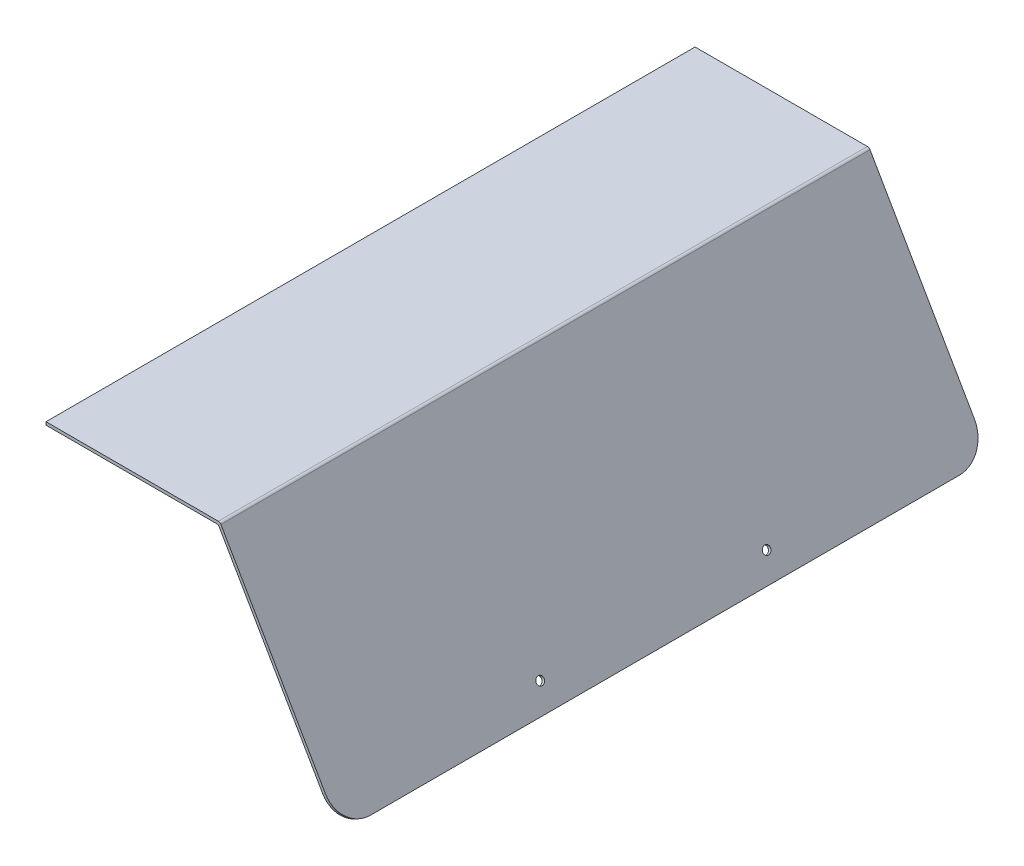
ISO-10303-21;
HEADER;
FILE_DESCRIPTION(('STEP AP214'),'2;1');
FILE_NAME('part.step','',(''),(''),'','','');
FILE_SCHEMA(('AUTOMOTIVE_DESIGN { 1 0 10303 214 1 1 1 1 }'));
ENDSEC;
DATA;
#1=APPLICATION_CONTEXT('core data for automotive mechanical design processes');
#2=APPLICATION_PROTOCOL_DEFINITION('international standard','automotive_design',2000,#1);
#3=PRODUCT_CONTEXT('',#1,'mechanical');
#4=PRODUCT('Part','Part','',(#3));
#5=PRODUCT_RELATED_PRODUCT_CATEGORY('part','',(#4));
#6=PRODUCT_DEFINITION_FORMATION('','',#4);
#7=PRODUCT_DEFINITION_CONTEXT('part definition',#1,'design');
#8=PRODUCT_DEFINITION('design','',#6,#7);
#9=PRODUCT_DEFINITION_SHAPE('','',#8);
#10=(LENGTH_UNIT() NAMED_UNIT(*) SI_UNIT(.MILLI.,.METRE.));
#11=(NAMED_UNIT(*) PLANE_ANGLE_UNIT() SI_UNIT($,.RADIAN.));
#12=(NAMED_UNIT(*) SI_UNIT($,.STERADIAN.) SOLID_ANGLE_UNIT());
#13=UNCERTAINTY_MEASURE_WITH_UNIT(LENGTH_MEASURE(1.E-05),#10,'distance_accuracy_value','');
#14=(GEOMETRIC_REPRESENTATION_CONTEXT(3) GLOBAL_UNCERTAINTY_ASSIGNED_CONTEXT((#13)) GLOBAL_UNIT_ASSIGNED_CONTEXT((#10,
#11,#12)) REPRESENTATION_CONTEXT('',''));
#15=CARTESIAN_POINT('',(0.,0.,0.));
#16=DIRECTION('',(0.,0.,1.));
#17=DIRECTION('',(1.,0.,0.));
#18=AXIS2_PLACEMENT_3D('',#15,#16,#17);
#19=CARTESIAN_POINT('',(39.,135.000000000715,-669.643858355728));
#20=DIRECTION('',(-1.,0.,0.));
#21=DIRECTION('',(0.,0.,1.));
#22=AXIS2_PLACEMENT_3D('',#19,#20,#21);
#23=PLANE('',#22);
#24=DIRECTION('',(0.,1.,0.));
#25=VECTOR('',#24,1.);
#26=CARTESIAN_POINT('',(39.,135.000000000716,-430.));
#27=LINE('',#26,#25);
#28=CARTESIAN_POINT('',(39.,135.000000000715,-430.));
#29=VERTEX_POINT('',#28);
#30=CARTESIAN_POINT('',(39.,137.000000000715,-430.));
#31=VERTEX_POINT('',#30);
#32=EDGE_CURVE('E125',#29,#31,#27,.T.);
#33=ORIENTED_EDGE('',*,*,#32,.F.);
#34=DIRECTION('',(0.,0.,1.));
#35=VECTOR('',#34,1.);
#36=CARTESIAN_POINT('',(39.,135.000000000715,-669.643858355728));
#37=LINE('',#36,#35);
#38=CARTESIAN_POINT('',(39.,135.000000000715,0.));
#39=VERTEX_POINT('',#38);
#40=EDGE_CURVE('E119',#29,#39,#37,.T.);
#41=ORIENTED_EDGE('',*,*,#40,.T.);
#42=DIRECTION('',(0.,-1.,0.));
#43=VECTOR('',#42,1.);
#44=CARTESIAN_POINT('',(39.,135.000000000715,0.));
#45=LINE('',#44,#43);
#46=CARTESIAN_POINT('',(39.,137.000000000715,0.));
#47=VERTEX_POINT('',#46);
#48=EDGE_CURVE('E123',#47,#39,#45,.T.);
#49=ORIENTED_EDGE('',*,*,#48,.F.);
#50=DIRECTION('',(0.,0.,1.));
#51=VECTOR('',#50,1.);
#52=CARTESIAN_POINT('',(39.,137.000000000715,-669.643858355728));
#53=LINE('',#52,#51);
#54=EDGE_CURVE('E160',#31,#47,#53,.T.);
#55=ORIENTED_EDGE('',*,*,#54,.F.);
#56=EDGE_LOOP('',(#33,#41,#49,#55));
#57=FACE_BOUND('',#56,.T.);
#58=ADVANCED_FACE('F39',(#57),#23,.T.);
#59=CARTESIAN_POINT('',(39.,137.000000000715,-669.643858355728));
#60=DIRECTION('',(0.,1.,0.));
#61=DIRECTION('',(-1.,0.,0.));
#62=AXIS2_PLACEMENT_3D('',#59,#60,#61);
#63=PLANE('',#62);
#64=DIRECTION('',(1.,0.,0.));
#65=VECTOR('',#64,1.);
#66=CARTESIAN_POINT('',(39.,137.000000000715,-430.));
#67=LINE('',#66,#65);
#68=CARTESIAN_POINT('',(153.154700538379,137.000000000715,-430.));
#69=VERTEX_POINT('',#68);
#70=EDGE_CURVE('E212',#31,#69,#67,.T.);
#71=ORIENTED_EDGE('',*,*,#70,.F.);
#72=ORIENTED_EDGE('',*,*,#54,.T.);
#73=DIRECTION('',(-1.,0.,0.));
#74=VECTOR('',#73,1.);
#75=CARTESIAN_POINT('',(39.,137.000000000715,0.));
#76=LINE('',#75,#74);
#77=CARTESIAN_POINT('',(153.154700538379,137.000000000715,0.));
#78=VERTEX_POINT('',#77);
#79=EDGE_CURVE('E129',#78,#47,#76,.T.);
#80=ORIENTED_EDGE('',*,*,#79,.F.);
#81=DIRECTION('',(0.,0.,1.));
#82=VECTOR('',#81,1.);
#83=CARTESIAN_POINT('',(153.154700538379,137.000000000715,-669.643858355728));
#84=LINE('',#83,#82);
#85=EDGE_CURVE('E163',#69,#78,#84,.T.);
#86=ORIENTED_EDGE('',*,*,#85,.F.);
#87=EDGE_LOOP('',(#71,#72,#80,#86));
#88=FACE_BOUND('',#87,.T.);
#89=ADVANCED_FACE('F219',(#88),#63,.T.);
#90=CARTESIAN_POINT('',(153.154700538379,135.000000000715,-669.643858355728));
#91=DIRECTION('',(0.,0.,1.));
#92=DIRECTION('',(1.,0.,0.));
#93=AXIS2_PLACEMENT_3D('',#90,#91,#92);
#94=CYLINDRICAL_SURFACE('',#93,2.);
#95=CARTESIAN_POINT('',(153.154700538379,135.000000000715,-430.));
#96=DIRECTION('',(0.,0.,1.));
#97=DIRECTION('',(0.,-1.,0.));
#98=AXIS2_PLACEMENT_3D('',#95,#96,#97);
#99=CIRCLE('',#98,2.);
#100=CARTESIAN_POINT('',(154.886751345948,136.000000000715,-430.));
#101=VERTEX_POINT('',#100);
#102=EDGE_CURVE('E209',#69,#101,#99,.F.);
#103=ORIENTED_EDGE('',*,*,#102,.F.);
#104=ORIENTED_EDGE('',*,*,#85,.T.);
#105=CARTESIAN_POINT('',(153.154700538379,135.000000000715,0.));
#106=DIRECTION('',(0.,0.,1.));
#107=DIRECTION('',(-1.,0.,0.));
#108=AXIS2_PLACEMENT_3D('',#105,#106,#107);
#109=CIRCLE('',#108,2.);
#110=CARTESIAN_POINT('',(154.886751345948,136.000000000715,0.));
#111=VERTEX_POINT('',#110);
#112=EDGE_CURVE('E157',#111,#78,#109,.T.);
#113=ORIENTED_EDGE('',*,*,#112,.F.);
#114=DIRECTION('',(0.,0.,1.));
#115=VECTOR('',#114,1.);
#116=CARTESIAN_POINT('',(154.886751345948,136.000000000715,-669.643858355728));
#117=LINE('',#116,#115);
#118=EDGE_CURVE('E165',#101,#111,#117,.T.);
#119=ORIENTED_EDGE('',*,*,#118,.F.);
#120=EDGE_LOOP('',(#103,#104,#113,#119));
#121=FACE_BOUND('',#120,.T.);
#122=ADVANCED_FACE('F222',(#121),#94,.T.);
#123=CARTESIAN_POINT('',(154.886751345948,136.000000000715,-669.643858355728));
#124=DIRECTION('',(0.86602540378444,0.499999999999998,0.));
#125=DIRECTION('',(-0.499999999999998,0.86602540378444,0.));
#126=AXIS2_PLACEMENT_3D('',#123,#124,#125);
#127=PLANE('',#126);
#128=CARTESIAN_POINT('',(226.411412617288,12.1156526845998,-139.999999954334));
#129=DIRECTION('',(0.86602540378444,0.499999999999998,0.));
#130=DIRECTION('',(-0.499999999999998,0.86602540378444,0.));
#131=AXIS2_PLACEMENT_3D('',#128,#129,#130);
#132=CIRCLE('',#131,2.58750000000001);
#133=CARTESIAN_POINT('',(225.117662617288,14.356493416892,-139.999999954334));
#134=VERTEX_POINT('',#133);
#135=EDGE_CURVE('E147',#134,#134,#132,.T.);
#136=ORIENTED_EDGE('',*,*,#135,.F.);
#137=EDGE_LOOP('',(#136));
#138=FACE_BOUND('',#137,.T.);
#139=CARTESIAN_POINT('',(226.411412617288,12.1156526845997,-290.000000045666));
#140=DIRECTION('',(0.86602540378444,0.499999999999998,0.));
#141=DIRECTION('',(-0.499999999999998,0.86602540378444,0.));
#142=AXIS2_PLACEMENT_3D('',#139,#140,#141);
#143=CIRCLE('',#142,2.58749999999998);
#144=CARTESIAN_POINT('',(225.117662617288,14.3564934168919,-290.000000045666));
#145=VERTEX_POINT('',#144);
#146=EDGE_CURVE('E271',#145,#145,#143,.T.);
#147=ORIENTED_EDGE('',*,*,#146,.F.);
#148=EDGE_LOOP('',(#147));
#149=FACE_BOUND('',#148,.T.);
#150=DIRECTION('',(-0.499999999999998,0.866025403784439,0.));
#151=VECTOR('',#150,1.);
#152=CARTESIAN_POINT('',(154.886751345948,136.000000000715,0.));
#153=LINE('',#152,#151);
#154=CARTESIAN_POINT('',(224.086412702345,16.142670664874,0.));
#155=VERTEX_POINT('',#154);
#156=EDGE_CURVE('E155',#155,#111,#153,.T.);
#157=ORIENTED_EDGE('',*,*,#156,.F.);
#158=CARTESIAN_POINT('',(224.086412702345,16.142670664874,-20.));
#159=DIRECTION('',(0.86602540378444,0.499999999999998,0.));
#160=DIRECTION('',(-0.499999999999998,0.86602540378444,0.));
#161=AXIS2_PLACEMENT_3D('',#158,#159,#160);
#162=CIRCLE('',#161,20.);
#163=CARTESIAN_POINT('',(234.086412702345,-1.17783741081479,-20.));
#164=VERTEX_POINT('',#163);
#165=EDGE_CURVE('E182',#155,#164,#162,.T.);
#166=ORIENTED_EDGE('',*,*,#165,.T.);
#167=DIRECTION('',(0.,0.,1.));
#168=VECTOR('',#167,1.);
#169=CARTESIAN_POINT('',(234.086412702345,-1.17783741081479,-669.643858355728));
#170=LINE('',#169,#168);
#171=CARTESIAN_POINT('',(234.086412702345,-1.17783741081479,-410.));
#172=VERTEX_POINT('',#171);
#173=EDGE_CURVE('E168',#172,#164,#170,.T.);
#174=ORIENTED_EDGE('',*,*,#173,.F.);
#175=CARTESIAN_POINT('',(224.086412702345,16.142670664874,-410.));
#176=DIRECTION('',(0.86602540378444,0.499999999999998,0.));
#177=DIRECTION('',(-0.499999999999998,0.86602540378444,0.));
#178=AXIS2_PLACEMENT_3D('',#175,#176,#177);
#179=CIRCLE('',#178,20.);
#180=CARTESIAN_POINT('',(224.086412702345,16.142670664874,-430.));
#181=VERTEX_POINT('',#180);
#182=EDGE_CURVE('E180',#172,#181,#179,.T.);
#183=ORIENTED_EDGE('',*,*,#182,.T.);
#184=DIRECTION('',(0.499999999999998,-0.86602540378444,0.));
#185=VECTOR('',#184,1.);
#186=CARTESIAN_POINT('',(154.886751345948,136.000000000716,-430.));
#187=LINE('',#186,#185);
#188=EDGE_CURVE('E203',#101,#181,#187,.T.);
#189=ORIENTED_EDGE('',*,*,#188,.F.);
#190=ORIENTED_EDGE('',*,*,#118,.T.);
#191=EDGE_LOOP('',(#157,#166,#174,#183,#189,#190));
#192=FACE_BOUND('',#191,.T.);
#193=ADVANCED_FACE('F198',(#138,#149,#192),#127,.T.);
#194=CARTESIAN_POINT('',(232.354361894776,-2.1778374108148,-669.643858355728));
#195=DIRECTION('',(0.499999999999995,-0.866025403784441,0.));
#196=DIRECTION('',(0.866025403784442,0.499999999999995,0.));
#197=AXIS2_PLACEMENT_3D('',#194,#195,#196);
#198=PLANE('',#197);
#199=ORIENTED_EDGE('',*,*,#173,.T.);
#200=DIRECTION('',(0.866025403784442,0.499999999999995,0.));
#201=VECTOR('',#200,1.);
#202=CARTESIAN_POINT('',(232.354361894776,-2.1778374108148,-20.));
#203=LINE('',#202,#201);
#204=CARTESIAN_POINT('',(232.354361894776,-2.1778374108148,-20.));
#205=VERTEX_POINT('',#204);
#206=EDGE_CURVE('E61',#164,#205,#203,.F.);
#207=ORIENTED_EDGE('',*,*,#206,.T.);
#208=DIRECTION('',(0.,0.,1.));
#209=VECTOR('',#208,1.);
#210=CARTESIAN_POINT('',(232.354361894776,-2.1778374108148,-669.643858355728));
#211=LINE('',#210,#209);
#212=CARTESIAN_POINT('',(232.354361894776,-2.1778374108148,-410.));
#213=VERTEX_POINT('',#212);
#214=EDGE_CURVE('E170',#213,#205,#211,.T.);
#215=ORIENTED_EDGE('',*,*,#214,.F.);
#216=DIRECTION('',(-0.866025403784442,-0.499999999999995,0.));
#217=VECTOR('',#216,1.);
#218=CARTESIAN_POINT('',(234.086412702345,-1.17783741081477,-410.));
#219=LINE('',#218,#217);
#220=EDGE_CURVE('E184',#213,#172,#219,.F.);
#221=ORIENTED_EDGE('',*,*,#220,.T.);
#222=EDGE_LOOP('',(#199,#207,#215,#221));
#223=FACE_BOUND('',#222,.T.);
#224=ADVANCED_FACE('F200',(#223),#198,.T.);
#225=CARTESIAN_POINT('',(153.732050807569,134.000000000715,-669.643858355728));
#226=DIRECTION('',(-0.86602540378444,-0.499999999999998,0.));
#227=DIRECTION('',(0.499999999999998,-0.86602540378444,0.));
#228=AXIS2_PLACEMENT_3D('',#225,#226,#227);
#229=PLANE('',#228);
#230=CARTESIAN_POINT('',(224.679361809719,11.1156526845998,-139.999999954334));
#231=DIRECTION('',(-0.86602540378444,-0.499999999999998,0.));
#232=DIRECTION('',(0.499999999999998,-0.86602540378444,0.));
#233=AXIS2_PLACEMENT_3D('',#230,#231,#232);
#234=CIRCLE('',#233,2.58750000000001);
#235=CARTESIAN_POINT('',(225.973111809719,8.87481195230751,-139.999999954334));
#236=VERTEX_POINT('',#235);
#237=EDGE_CURVE('E144',#236,#236,#234,.F.);
#238=ORIENTED_EDGE('',*,*,#237,.T.);
#239=EDGE_LOOP('',(#238));
#240=FACE_BOUND('',#239,.T.);
#241=CARTESIAN_POINT('',(224.679361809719,11.1156526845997,-290.000000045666));
#242=DIRECTION('',(-0.86602540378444,-0.499999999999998,0.));
#243=DIRECTION('',(0.499999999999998,-0.86602540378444,0.));
#244=AXIS2_PLACEMENT_3D('',#241,#242,#243);
#245=CIRCLE('',#244,2.58749999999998);
#246=CARTESIAN_POINT('',(225.973111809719,8.87481195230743,-290.000000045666));
#247=VERTEX_POINT('',#246);
#248=EDGE_CURVE('E269',#247,#247,#245,.F.);
#249=ORIENTED_EDGE('',*,*,#248,.T.);
#250=EDGE_LOOP('',(#249));
#251=FACE_BOUND('',#250,.T.);
#252=ORIENTED_EDGE('',*,*,#214,.T.);
#253=CARTESIAN_POINT('',(222.354361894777,15.142670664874,-20.));
#254=DIRECTION('',(-0.86602540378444,-0.499999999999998,0.));
#255=DIRECTION('',(0.499999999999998,-0.86602540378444,0.));
#256=AXIS2_PLACEMENT_3D('',#253,#254,#255);
#257=CIRCLE('',#256,20.);
#258=CARTESIAN_POINT('',(222.354361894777,15.142670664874,0.));
#259=VERTEX_POINT('',#258);
#260=EDGE_CURVE('E47',#205,#259,#257,.T.);
#261=ORIENTED_EDGE('',*,*,#260,.T.);
#262=DIRECTION('',(0.499999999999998,-0.86602540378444,0.));
#263=VECTOR('',#262,1.);
#264=CARTESIAN_POINT('',(153.732050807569,134.000000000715,0.));
#265=LINE('',#264,#263);
#266=CARTESIAN_POINT('',(153.732050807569,134.000000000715,0.));
#267=VERTEX_POINT('',#266);
#268=EDGE_CURVE('E153',#267,#259,#265,.T.);
#269=ORIENTED_EDGE('',*,*,#268,.F.);
#270=DIRECTION('',(0.,0.,1.));
#271=VECTOR('',#270,1.);
#272=CARTESIAN_POINT('',(153.732050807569,134.000000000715,-669.643858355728));
#273=LINE('',#272,#271);
#274=CARTESIAN_POINT('',(153.732050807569,134.000000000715,-430.));
#275=VERTEX_POINT('',#274);
#276=EDGE_CURVE('E172',#275,#267,#273,.T.);
#277=ORIENTED_EDGE('',*,*,#276,.F.);
#278=DIRECTION('',(-0.499999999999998,0.86602540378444,0.));
#279=VECTOR('',#278,1.);
#280=CARTESIAN_POINT('',(153.732050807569,134.000000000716,-430.));
#281=LINE('',#280,#279);
#282=CARTESIAN_POINT('',(222.354361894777,15.1426706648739,-430.));
#283=VERTEX_POINT('',#282);
#284=EDGE_CURVE('E210',#283,#275,#281,.T.);
#285=ORIENTED_EDGE('',*,*,#284,.F.);
#286=CARTESIAN_POINT('',(222.354361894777,15.142670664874,-410.));
#287=DIRECTION('',(-0.86602540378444,-0.499999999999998,0.));
#288=DIRECTION('',(0.499999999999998,-0.86602540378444,0.));
#289=AXIS2_PLACEMENT_3D('',#286,#287,#288);
#290=CIRCLE('',#289,20.);
#291=EDGE_CURVE('E54',#283,#213,#290,.T.);
#292=ORIENTED_EDGE('',*,*,#291,.T.);
#293=EDGE_LOOP('',(#252,#261,#269,#277,#285,#292));
#294=FACE_BOUND('',#293,.T.);
#295=ADVANCED_FACE('F190',(#240,#251,#294),#229,.T.);
#296=CARTESIAN_POINT('',(152.,133.000000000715,-669.643858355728));
#297=DIRECTION('',(0.,0.,1.));
#298=DIRECTION('',(1.,0.,0.));
#299=AXIS2_PLACEMENT_3D('',#296,#297,#298);
#300=CYLINDRICAL_SURFACE('',#299,1.99999999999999);
#301=CARTESIAN_POINT('',(152.,133.000000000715,-430.));
#302=DIRECTION('',(0.,0.,1.));
#303=DIRECTION('',(0.,-1.,0.));
#304=AXIS2_PLACEMENT_3D('',#301,#302,#303);
#305=CIRCLE('',#304,1.99999999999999);
#306=CARTESIAN_POINT('',(152.,135.000000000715,-430.));
#307=VERTEX_POINT('',#306);
#308=EDGE_CURVE('E162',#275,#307,#305,.T.);
#309=ORIENTED_EDGE('',*,*,#308,.F.);
#310=ORIENTED_EDGE('',*,*,#276,.T.);
#311=CARTESIAN_POINT('',(152.,133.000000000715,0.));
#312=DIRECTION('',(0.,0.,-1.));
#313=DIRECTION('',(-1.,0.,0.));
#314=AXIS2_PLACEMENT_3D('',#311,#312,#313);
#315=CIRCLE('',#314,1.99999999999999);
#316=CARTESIAN_POINT('',(152.,135.000000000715,0.));
#317=VERTEX_POINT('',#316);
#318=EDGE_CURVE('E138',#317,#267,#315,.T.);
#319=ORIENTED_EDGE('',*,*,#318,.F.);
#320=DIRECTION('',(0.,0.,1.));
#321=VECTOR('',#320,1.);
#322=CARTESIAN_POINT('',(152.,135.000000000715,-669.643858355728));
#323=LINE('',#322,#321);
#324=EDGE_CURVE('E128',#307,#317,#323,.T.);
#325=ORIENTED_EDGE('',*,*,#324,.F.);
#326=EDGE_LOOP('',(#309,#310,#319,#325));
#327=FACE_BOUND('',#326,.T.);
#328=ADVANCED_FACE('F265',(#327),#300,.F.);
#329=CARTESIAN_POINT('',(39.,135.000000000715,-669.643858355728));
#330=DIRECTION('',(0.,-1.,0.));
#331=DIRECTION('',(1.,0.,0.));
#332=AXIS2_PLACEMENT_3D('',#329,#330,#331);
#333=PLANE('',#332);
#334=DIRECTION('',(-1.,0.,0.));
#335=VECTOR('',#334,1.);
#336=CARTESIAN_POINT('',(39.,135.000000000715,-430.));
#337=LINE('',#336,#335);
#338=EDGE_CURVE('E175',#307,#29,#337,.T.);
#339=ORIENTED_EDGE('',*,*,#338,.F.);
#340=ORIENTED_EDGE('',*,*,#324,.T.);
#341=DIRECTION('',(1.,0.,0.));
#342=VECTOR('',#341,1.);
#343=CARTESIAN_POINT('',(39.,135.000000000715,0.));
#344=LINE('',#343,#342);
#345=EDGE_CURVE('E132',#39,#317,#344,.T.);
#346=ORIENTED_EDGE('',*,*,#345,.F.);
#347=ORIENTED_EDGE('',*,*,#40,.F.);
#348=EDGE_LOOP('',(#339,#340,#346,#347));
#349=FACE_BOUND('',#348,.T.);
#350=ADVANCED_FACE('F133',(#349),#333,.T.);
#351=CARTESIAN_POINT('',(153.154700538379,135.000000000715,0.));
#352=DIRECTION('',(0.,0.,-1.));
#353=DIRECTION('',(-1.,0.,0.));
#354=AXIS2_PLACEMENT_3D('',#351,#352,#353);
#355=PLANE('',#354);
#356=ORIENTED_EDGE('',*,*,#268,.T.);
#357=DIRECTION('',(0.866025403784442,0.499999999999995,0.));
#358=VECTOR('',#357,1.);
#359=CARTESIAN_POINT('',(224.086412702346,16.142670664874,0.));
#360=LINE('',#359,#358);
#361=EDGE_CURVE('E177',#259,#155,#360,.T.);
#362=ORIENTED_EDGE('',*,*,#361,.T.);
#363=ORIENTED_EDGE('',*,*,#156,.T.);
#364=ORIENTED_EDGE('',*,*,#112,.T.);
#365=ORIENTED_EDGE('',*,*,#79,.T.);
#366=ORIENTED_EDGE('',*,*,#48,.T.);
#367=ORIENTED_EDGE('',*,*,#345,.T.);
#368=ORIENTED_EDGE('',*,*,#318,.T.);
#369=EDGE_LOOP('',(#356,#362,#363,#364,#365,#366,#367,#368));
#370=FACE_BOUND('',#369,.T.);
#371=ADVANCED_FACE('F141',(#370),#355,.F.);
#372=CARTESIAN_POINT('',(150.,131.000000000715,-430.));
#373=DIRECTION('',(0.,0.,1.));
#374=DIRECTION('',(0.,-1.,0.));
#375=AXIS2_PLACEMENT_3D('',#372,#373,#374);
#376=PLANE('',#375);
#377=ORIENTED_EDGE('',*,*,#188,.T.);
#378=DIRECTION('',(-0.866025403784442,-0.499999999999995,0.));
#379=VECTOR('',#378,1.);
#380=CARTESIAN_POINT('',(222.354361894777,15.142670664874,-430.));
#381=LINE('',#380,#379);
#382=EDGE_CURVE('E11',#181,#283,#381,.T.);
#383=ORIENTED_EDGE('',*,*,#382,.T.);
#384=ORIENTED_EDGE('',*,*,#284,.T.);
#385=ORIENTED_EDGE('',*,*,#308,.T.);
#386=ORIENTED_EDGE('',*,*,#338,.T.);
#387=ORIENTED_EDGE('',*,*,#32,.T.);
#388=ORIENTED_EDGE('',*,*,#70,.T.);
#389=ORIENTED_EDGE('',*,*,#102,.T.);
#390=EDGE_LOOP('',(#377,#383,#384,#385,#386,#387,#388,#389));
#391=FACE_BOUND('',#390,.T.);
#392=ADVANCED_FACE('F206',(#391),#376,.F.);
#393=CARTESIAN_POINT('',(222.354361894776,15.1426706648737,-20.));
#394=DIRECTION('',(-0.866025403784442,-0.499999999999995,0.));
#395=DIRECTION('',(0.499999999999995,-0.866025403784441,0.));
#396=AXIS2_PLACEMENT_3D('',#393,#394,#395);
#397=CYLINDRICAL_SURFACE('',#396,20.);
#398=ORIENTED_EDGE('',*,*,#260,.F.);
#399=ORIENTED_EDGE('',*,*,#206,.F.);
#400=ORIENTED_EDGE('',*,*,#165,.F.);
#401=ORIENTED_EDGE('',*,*,#361,.F.);
#402=EDGE_LOOP('',(#398,#399,#400,#401));
#403=FACE_BOUND('',#402,.T.);
#404=ADVANCED_FACE('F195',(#403),#397,.T.);
#405=CARTESIAN_POINT('',(218.256285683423,12.7766452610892,-410.));
#406=DIRECTION('',(0.866025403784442,0.499999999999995,0.));
#407=DIRECTION('',(-0.499999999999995,0.866025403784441,0.));
#408=AXIS2_PLACEMENT_3D('',#405,#406,#407);
#409=CYLINDRICAL_SURFACE('',#408,20.);
#410=ORIENTED_EDGE('',*,*,#182,.F.);
#411=ORIENTED_EDGE('',*,*,#220,.F.);
#412=ORIENTED_EDGE('',*,*,#291,.F.);
#413=ORIENTED_EDGE('',*,*,#382,.F.);
#414=EDGE_LOOP('',(#410,#411,#412,#413));
#415=FACE_BOUND('',#414,.T.);
#416=ADVANCED_FACE('F41',(#415),#409,.T.);
#417=CARTESIAN_POINT('',(218.341307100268,7.45637509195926,-290.000000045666));
#418=DIRECTION('',(0.86602540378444,0.499999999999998,0.));
#419=DIRECTION('',(-0.499999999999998,0.86602540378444,0.));
#420=AXIS2_PLACEMENT_3D('',#417,#418,#419);
#421=CYLINDRICAL_SURFACE('',#420,2.58749999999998);
#422=ORIENTED_EDGE('',*,*,#146,.T.);
#423=EDGE_LOOP('',(#422));
#424=FACE_BOUND('',#423,.T.);
#425=ORIENTED_EDGE('',*,*,#248,.F.);
#426=EDGE_LOOP('',(#425));
#427=FACE_BOUND('',#426,.T.);
#428=ADVANCED_FACE('F243',(#424,#427),#421,.F.);
#429=CARTESIAN_POINT('',(218.341307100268,7.45637509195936,-139.999999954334));
#430=DIRECTION('',(0.86602540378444,0.499999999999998,0.));
#431=DIRECTION('',(-0.499999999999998,0.86602540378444,0.));
#432=AXIS2_PLACEMENT_3D('',#429,#430,#431);
#433=CYLINDRICAL_SURFACE('',#432,2.58750000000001);
#434=ORIENTED_EDGE('',*,*,#135,.T.);
#435=EDGE_LOOP('',(#434));
#436=FACE_BOUND('',#435,.T.);
#437=ORIENTED_EDGE('',*,*,#237,.F.);
#438=EDGE_LOOP('',(#437));
#439=FACE_BOUND('',#438,.T.);
#440=ADVANCED_FACE('F252',(#436,#439),#433,.F.);
#441=CLOSED_SHELL('',(#58,#89,#122,#193,#224,#295,#328,#350,#371,#392,#404,#416,#428,#440));
#442=MANIFOLD_SOLID_BREP('B2',#441);
#443=ADVANCED_BREP_SHAPE_REPRESENTATION('',(#18,#442),#14);
#444=SHAPE_DEFINITION_REPRESENTATION(#9,#443);
ENDSEC;
END-ISO-10303-21;
